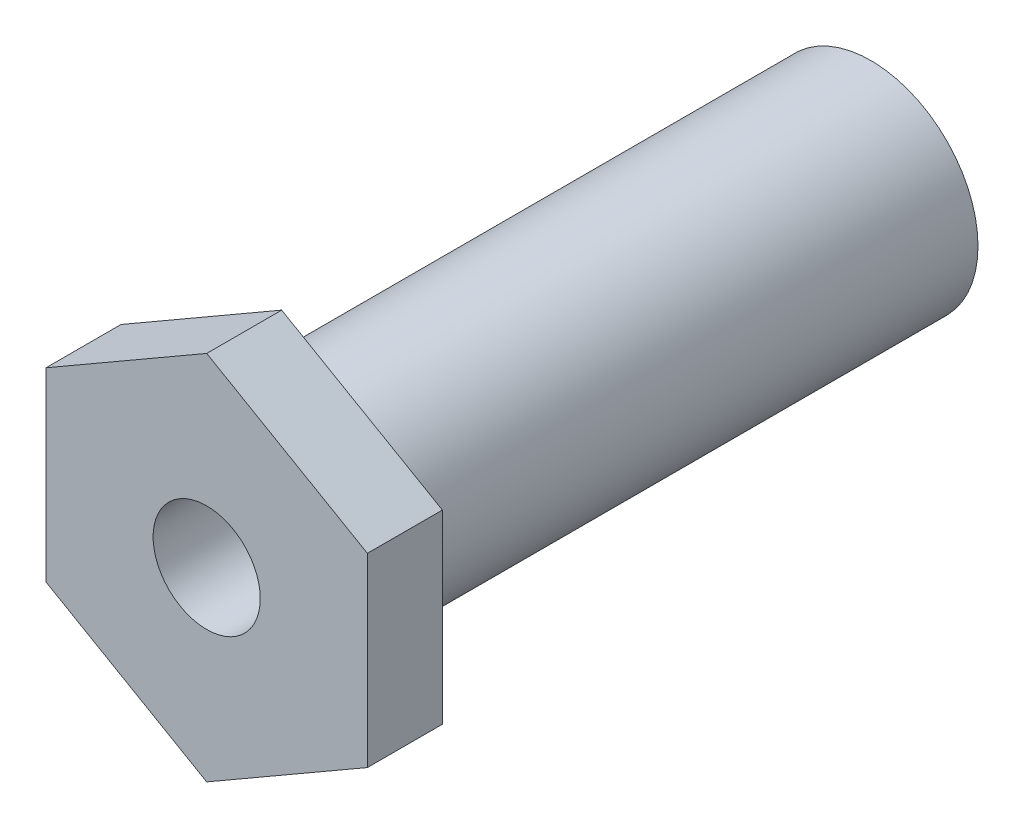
ISO-10303-21;
HEADER;
FILE_DESCRIPTION(('STEP AP214'),'2;1');
FILE_NAME('part.step','',(''),(''),'','','');
FILE_SCHEMA(('AUTOMOTIVE_DESIGN { 1 0 10303 214 1 1 1 1 }'));
ENDSEC;
DATA;
#1=APPLICATION_CONTEXT('core data for automotive mechanical design processes');
#2=APPLICATION_PROTOCOL_DEFINITION('international standard','automotive_design',2000,#1);
#3=PRODUCT_CONTEXT('',#1,'mechanical');
#4=PRODUCT('Part','Part','',(#3));
#5=PRODUCT_RELATED_PRODUCT_CATEGORY('part','',(#4));
#6=PRODUCT_DEFINITION_FORMATION('','',#4);
#7=PRODUCT_DEFINITION_CONTEXT('part definition',#1,'design');
#8=PRODUCT_DEFINITION('design','',#6,#7);
#9=PRODUCT_DEFINITION_SHAPE('','',#8);
#10=(LENGTH_UNIT() NAMED_UNIT(*) SI_UNIT(.MILLI.,.METRE.));
#11=(NAMED_UNIT(*) PLANE_ANGLE_UNIT() SI_UNIT($,.RADIAN.));
#12=(NAMED_UNIT(*) SI_UNIT($,.STERADIAN.) SOLID_ANGLE_UNIT());
#13=UNCERTAINTY_MEASURE_WITH_UNIT(LENGTH_MEASURE(1.E-05),#10,'distance_accuracy_value','');
#14=(GEOMETRIC_REPRESENTATION_CONTEXT(3) GLOBAL_UNCERTAINTY_ASSIGNED_CONTEXT((#13)) GLOBAL_UNIT_ASSIGNED_CONTEXT((#10,
#11,#12)) REPRESENTATION_CONTEXT('',''));
#15=CARTESIAN_POINT('',(0.,0.,0.));
#16=DIRECTION('',(0.,0.,1.));
#17=DIRECTION('',(1.,0.,0.));
#18=AXIS2_PLACEMENT_3D('',#15,#16,#17);
#19=CARTESIAN_POINT('',(0.,0.,50.));
#20=DIRECTION('',(0.,0.,1.));
#21=DIRECTION('',(1.,0.,0.));
#22=AXIS2_PLACEMENT_3D('',#19,#20,#21);
#23=PLANE('',#22);
#24=CARTESIAN_POINT('',(0.,0.,50.));
#25=DIRECTION('',(0.,0.,1.));
#26=DIRECTION('',(1.,0.,0.));
#27=AXIS2_PLACEMENT_3D('',#24,#25,#26);
#28=CIRCLE('',#27,5.);
#29=CARTESIAN_POINT('',(5.,0.,50.));
#30=VERTEX_POINT('',#29);
#31=EDGE_CURVE('E112',#30,#30,#28,.T.);
#32=ORIENTED_EDGE('',*,*,#31,.T.);
#33=EDGE_LOOP('',(#32));
#34=FACE_BOUND('',#33,.T.);
#35=ADVANCED_FACE('F14',(#34),#23,.T.);
#36=CARTESIAN_POINT('',(0.,0.,60.));
#37=DIRECTION('',(0.,0.,1.));
#38=DIRECTION('',(1.,0.,0.));
#39=AXIS2_PLACEMENT_3D('',#36,#37,#38);
#40=CYLINDRICAL_SURFACE('',#39,5.);
#41=CARTESIAN_POINT('',(0.,0.,62.));
#42=DIRECTION('',(0.,0.,1.));
#43=DIRECTION('',(1.,0.,0.));
#44=AXIS2_PLACEMENT_3D('',#41,#42,#43);
#45=CIRCLE('',#44,5.);
#46=CARTESIAN_POINT('',(5.,0.,62.));
#47=VERTEX_POINT('',#46);
#48=EDGE_CURVE('E109',#47,#47,#45,.T.);
#49=ORIENTED_EDGE('',*,*,#48,.T.);
#50=EDGE_LOOP('',(#49));
#51=FACE_BOUND('',#50,.T.);
#52=ORIENTED_EDGE('',*,*,#31,.F.);
#53=EDGE_LOOP('',(#52));
#54=FACE_BOUND('',#53,.T.);
#55=ADVANCED_FACE('F151',(#51,#54),#40,.F.);
#56=CARTESIAN_POINT('',(-5.,0.,62.));
#57=DIRECTION('',(0.,0.,1.));
#58=DIRECTION('',(1.,0.,0.));
#59=AXIS2_PLACEMENT_3D('',#56,#57,#58);
#60=PLANE('',#59);
#61=DIRECTION('',(-0.866025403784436,-0.5,0.));
#62=VECTOR('',#61,1.);
#63=CARTESIAN_POINT('',(15.,-8.66025403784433,62.));
#64=LINE('',#63,#62);
#65=CARTESIAN_POINT('',(15.,-8.66025403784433,62.));
#66=VERTEX_POINT('',#65);
#67=CARTESIAN_POINT('',(0.,-17.3205080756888,62.));
#68=VERTEX_POINT('',#67);
#69=EDGE_CURVE('E80',#66,#68,#64,.T.);
#70=ORIENTED_EDGE('',*,*,#69,.F.);
#71=DIRECTION('',(0.,1.,0.));
#72=VECTOR('',#71,1.);
#73=CARTESIAN_POINT('',(15.,-8.66025403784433,62.));
#74=LINE('',#73,#72);
#75=CARTESIAN_POINT('',(15.,8.66025403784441,62.));
#76=VERTEX_POINT('',#75);
#77=EDGE_CURVE('E97',#66,#76,#74,.T.);
#78=ORIENTED_EDGE('',*,*,#77,.T.);
#79=DIRECTION('',(-0.86602540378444,0.5,0.));
#80=VECTOR('',#79,1.);
#81=CARTESIAN_POINT('',(15.,8.66025403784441,62.));
#82=LINE('',#81,#80);
#83=CARTESIAN_POINT('',(0.,17.3205080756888,62.));
#84=VERTEX_POINT('',#83);
#85=EDGE_CURVE('E28',#76,#84,#82,.T.);
#86=ORIENTED_EDGE('',*,*,#85,.T.);
#87=DIRECTION('',(0.86602540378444,0.5,0.));
#88=VECTOR('',#87,1.);
#89=CARTESIAN_POINT('',(-15.,8.66025403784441,62.));
#90=LINE('',#89,#88);
#91=CARTESIAN_POINT('',(-15.,8.66025403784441,62.));
#92=VERTEX_POINT('',#91);
#93=EDGE_CURVE('E91',#92,#84,#90,.T.);
#94=ORIENTED_EDGE('',*,*,#93,.F.);
#95=DIRECTION('',(0.,1.,0.));
#96=VECTOR('',#95,1.);
#97=CARTESIAN_POINT('',(-15.,-8.66025403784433,62.));
#98=LINE('',#97,#96);
#99=CARTESIAN_POINT('',(-15.,-8.66025403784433,62.));
#100=VERTEX_POINT('',#99);
#101=EDGE_CURVE('E89',#100,#92,#98,.T.);
#102=ORIENTED_EDGE('',*,*,#101,.F.);
#103=DIRECTION('',(0.866025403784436,-0.5,0.));
#104=VECTOR('',#103,1.);
#105=CARTESIAN_POINT('',(-15.,-8.66025403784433,62.));
#106=LINE('',#105,#104);
#107=EDGE_CURVE('E71',#100,#68,#106,.T.);
#108=ORIENTED_EDGE('',*,*,#107,.T.);
#109=EDGE_LOOP('',(#70,#78,#86,#94,#102,#108));
#110=FACE_BOUND('',#109,.T.);
#111=ORIENTED_EDGE('',*,*,#48,.F.);
#112=EDGE_LOOP('',(#111));
#113=FACE_BOUND('',#112,.T.);
#114=ADVANCED_FACE('F85',(#110,#113),#60,.T.);
#115=CARTESIAN_POINT('',(15.,-8.66025403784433,52.));
#116=DIRECTION('',(-0.5,0.866025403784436,0.));
#117=DIRECTION('',(-0.866025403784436,-0.5,0.));
#118=AXIS2_PLACEMENT_3D('',#115,#116,#117);
#119=PLANE('',#118);
#120=DIRECTION('',(0.866025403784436,0.5,0.));
#121=VECTOR('',#120,1.);
#122=CARTESIAN_POINT('',(-7.49999999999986,-21.650635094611,55.));
#123=LINE('',#122,#121);
#124=CARTESIAN_POINT('',(0.,-17.3205080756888,55.));
#125=VERTEX_POINT('',#124);
#126=CARTESIAN_POINT('',(15.,-8.66025403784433,55.));
#127=VERTEX_POINT('',#126);
#128=EDGE_CURVE('E9',#125,#127,#123,.T.);
#129=ORIENTED_EDGE('',*,*,#128,.T.);
#130=DIRECTION('',(0.,0.,1.));
#131=VECTOR('',#130,1.);
#132=CARTESIAN_POINT('',(15.,-8.66025403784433,52.));
#133=LINE('',#132,#131);
#134=EDGE_CURVE('E36',#127,#66,#133,.T.);
#135=ORIENTED_EDGE('',*,*,#134,.T.);
#136=ORIENTED_EDGE('',*,*,#69,.T.);
#137=DIRECTION('',(0.,0.,1.));
#138=VECTOR('',#137,1.);
#139=CARTESIAN_POINT('',(0.,-17.3205080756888,52.));
#140=LINE('',#139,#138);
#141=EDGE_CURVE('E66',#125,#68,#140,.T.);
#142=ORIENTED_EDGE('',*,*,#141,.F.);
#143=EDGE_LOOP('',(#129,#135,#136,#142));
#144=FACE_BOUND('',#143,.T.);
#145=ADVANCED_FACE('F81',(#144),#119,.F.);
#146=CARTESIAN_POINT('',(-15.,-8.66025403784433,52.));
#147=DIRECTION('',(-0.5,-0.866025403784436,0.));
#148=DIRECTION('',(0.866025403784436,-0.5,0.));
#149=AXIS2_PLACEMENT_3D('',#146,#147,#148);
#150=PLANE('',#149);
#151=ORIENTED_EDGE('',*,*,#141,.T.);
#152=ORIENTED_EDGE('',*,*,#107,.F.);
#153=DIRECTION('',(0.,0.,1.));
#154=VECTOR('',#153,1.);
#155=CARTESIAN_POINT('',(-15.,-8.66025403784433,52.));
#156=LINE('',#155,#154);
#157=CARTESIAN_POINT('',(-15.,-8.66025403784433,55.));
#158=VERTEX_POINT('',#157);
#159=EDGE_CURVE('E77',#158,#100,#156,.T.);
#160=ORIENTED_EDGE('',*,*,#159,.F.);
#161=DIRECTION('',(-0.866025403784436,0.5,0.));
#162=VECTOR('',#161,1.);
#163=CARTESIAN_POINT('',(-22.5,-4.33012701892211,55.));
#164=LINE('',#163,#162);
#165=EDGE_CURVE('E21',#125,#158,#164,.T.);
#166=ORIENTED_EDGE('',*,*,#165,.F.);
#167=EDGE_LOOP('',(#151,#152,#160,#166));
#168=FACE_BOUND('',#167,.T.);
#169=ADVANCED_FACE('F68',(#168),#150,.T.);
#170=CARTESIAN_POINT('',(-15.,-8.66025403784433,52.));
#171=DIRECTION('',(1.,0.,0.));
#172=DIRECTION('',(0.,0.,-1.));
#173=AXIS2_PLACEMENT_3D('',#170,#171,#172);
#174=PLANE('',#173);
#175=DIRECTION('',(0.,-1.,0.));
#176=VECTOR('',#175,1.);
#177=CARTESIAN_POINT('',(-15.,0.,55.));
#178=LINE('',#177,#176);
#179=CARTESIAN_POINT('',(-15.,8.66025403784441,55.));
#180=VERTEX_POINT('',#179);
#181=EDGE_CURVE('E123',#180,#158,#178,.T.);
#182=ORIENTED_EDGE('',*,*,#181,.T.);
#183=ORIENTED_EDGE('',*,*,#159,.T.);
#184=ORIENTED_EDGE('',*,*,#101,.T.);
#185=DIRECTION('',(0.,0.,1.));
#186=VECTOR('',#185,1.);
#187=CARTESIAN_POINT('',(-15.,8.66025403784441,52.));
#188=LINE('',#187,#186);
#189=EDGE_CURVE('E101',#180,#92,#188,.T.);
#190=ORIENTED_EDGE('',*,*,#189,.F.);
#191=EDGE_LOOP('',(#182,#183,#184,#190));
#192=FACE_BOUND('',#191,.T.);
#193=ADVANCED_FACE('F139',(#192),#174,.F.);
#194=CARTESIAN_POINT('',(-15.,8.66025403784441,52.));
#195=DIRECTION('',(0.5,-0.86602540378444,0.));
#196=DIRECTION('',(0.86602540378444,0.5,0.));
#197=AXIS2_PLACEMENT_3D('',#194,#195,#196);
#198=PLANE('',#197);
#199=DIRECTION('',(-0.86602540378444,-0.5,0.));
#200=VECTOR('',#199,1.);
#201=CARTESIAN_POINT('',(-22.5,4.33012701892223,55.));
#202=LINE('',#201,#200);
#203=CARTESIAN_POINT('',(0.,17.3205080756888,55.));
#204=VERTEX_POINT('',#203);
#205=EDGE_CURVE('E121',#204,#180,#202,.T.);
#206=ORIENTED_EDGE('',*,*,#205,.T.);
#207=ORIENTED_EDGE('',*,*,#189,.T.);
#208=ORIENTED_EDGE('',*,*,#93,.T.);
#209=DIRECTION('',(0.,0.,1.));
#210=VECTOR('',#209,1.);
#211=CARTESIAN_POINT('',(0.,17.3205080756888,52.));
#212=LINE('',#211,#210);
#213=EDGE_CURVE('E99',#204,#84,#212,.T.);
#214=ORIENTED_EDGE('',*,*,#213,.F.);
#215=EDGE_LOOP('',(#206,#207,#208,#214));
#216=FACE_BOUND('',#215,.T.);
#217=ADVANCED_FACE('F134',(#216),#198,.F.);
#218=CARTESIAN_POINT('',(15.,8.66025403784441,52.));
#219=DIRECTION('',(0.5,0.86602540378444,0.));
#220=DIRECTION('',(-0.86602540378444,0.5,0.));
#221=AXIS2_PLACEMENT_3D('',#218,#219,#220);
#222=PLANE('',#221);
#223=ORIENTED_EDGE('',*,*,#213,.T.);
#224=ORIENTED_EDGE('',*,*,#85,.F.);
#225=DIRECTION('',(0.,0.,1.));
#226=VECTOR('',#225,1.);
#227=CARTESIAN_POINT('',(15.,8.66025403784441,52.));
#228=LINE('',#227,#226);
#229=CARTESIAN_POINT('',(15.,8.66025403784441,55.));
#230=VERTEX_POINT('',#229);
#231=EDGE_CURVE('E96',#230,#76,#228,.T.);
#232=ORIENTED_EDGE('',*,*,#231,.F.);
#233=DIRECTION('',(0.86602540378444,-0.5,0.));
#234=VECTOR('',#233,1.);
#235=CARTESIAN_POINT('',(-7.5,21.650635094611,55.));
#236=LINE('',#235,#234);
#237=EDGE_CURVE('E118',#204,#230,#236,.T.);
#238=ORIENTED_EDGE('',*,*,#237,.F.);
#239=EDGE_LOOP('',(#223,#224,#232,#238));
#240=FACE_BOUND('',#239,.T.);
#241=ADVANCED_FACE('F130',(#240),#222,.T.);
#242=CARTESIAN_POINT('',(15.,-8.66025403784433,52.));
#243=DIRECTION('',(1.,0.,0.));
#244=DIRECTION('',(0.,0.,-1.));
#245=AXIS2_PLACEMENT_3D('',#242,#243,#244);
#246=PLANE('',#245);
#247=ORIENTED_EDGE('',*,*,#231,.T.);
#248=ORIENTED_EDGE('',*,*,#77,.F.);
#249=ORIENTED_EDGE('',*,*,#134,.F.);
#250=DIRECTION('',(0.,-1.,0.));
#251=VECTOR('',#250,1.);
#252=CARTESIAN_POINT('',(15.,0.,55.));
#253=LINE('',#252,#251);
#254=EDGE_CURVE('E115',#230,#127,#253,.T.);
#255=ORIENTED_EDGE('',*,*,#254,.F.);
#256=EDGE_LOOP('',(#247,#248,#249,#255));
#257=FACE_BOUND('',#256,.T.);
#258=ADVANCED_FACE('F129',(#257),#246,.T.);
#259=CARTESIAN_POINT('',(-10.,0.,0.));
#260=DIRECTION('',(0.,0.,-1.));
#261=DIRECTION('',(-1.,0.,0.));
#262=AXIS2_PLACEMENT_3D('',#259,#260,#261);
#263=PLANE('',#262);
#264=CARTESIAN_POINT('',(0.,0.,0.));
#265=DIRECTION('',(0.,0.,1.));
#266=DIRECTION('',(1.,0.,0.));
#267=AXIS2_PLACEMENT_3D('',#264,#265,#266);
#268=CIRCLE('',#267,10.);
#269=CARTESIAN_POINT('',(10.,0.,0.));
#270=VERTEX_POINT('',#269);
#271=EDGE_CURVE('E76',#270,#270,#268,.T.);
#272=ORIENTED_EDGE('',*,*,#271,.F.);
#273=EDGE_LOOP('',(#272));
#274=FACE_BOUND('',#273,.T.);
#275=ADVANCED_FACE('F171',(#274),#263,.T.);
#276=CARTESIAN_POINT('',(0.,0.,60.));
#277=DIRECTION('',(0.,0.,1.));
#278=DIRECTION('',(1.,0.,0.));
#279=AXIS2_PLACEMENT_3D('',#276,#277,#278);
#280=CYLINDRICAL_SURFACE('',#279,10.);
#281=ORIENTED_EDGE('',*,*,#271,.T.);
#282=EDGE_LOOP('',(#281));
#283=FACE_BOUND('',#282,.T.);
#284=CARTESIAN_POINT('',(0.,0.,55.));
#285=DIRECTION('',(0.,0.,1.));
#286=DIRECTION('',(1.,0.,0.));
#287=AXIS2_PLACEMENT_3D('',#284,#285,#286);
#288=CIRCLE('',#287,10.);
#289=CARTESIAN_POINT('',(10.,0.,55.));
#290=VERTEX_POINT('',#289);
#291=EDGE_CURVE('E106',#290,#290,#288,.T.);
#292=ORIENTED_EDGE('',*,*,#291,.F.);
#293=EDGE_LOOP('',(#292));
#294=FACE_BOUND('',#293,.T.);
#295=ADVANCED_FACE('F168',(#283,#294),#280,.T.);
#296=CARTESIAN_POINT('',(-20.,0.,55.));
#297=DIRECTION('',(0.,0.,-1.));
#298=DIRECTION('',(-1.,0.,0.));
#299=AXIS2_PLACEMENT_3D('',#296,#297,#298);
#300=PLANE('',#299);
#301=ORIENTED_EDGE('',*,*,#128,.F.);
#302=ORIENTED_EDGE('',*,*,#165,.T.);
#303=ORIENTED_EDGE('',*,*,#181,.F.);
#304=ORIENTED_EDGE('',*,*,#205,.F.);
#305=ORIENTED_EDGE('',*,*,#237,.T.);
#306=ORIENTED_EDGE('',*,*,#254,.T.);
#307=EDGE_LOOP('',(#301,#302,#303,#304,#305,#306));
#308=FACE_BOUND('',#307,.T.);
#309=ORIENTED_EDGE('',*,*,#291,.T.);
#310=EDGE_LOOP('',(#309));
#311=FACE_BOUND('',#310,.T.);
#312=ADVANCED_FACE('F126',(#308,#311),#300,.T.);
#313=CLOSED_SHELL('',(#35,#55,#114,#145,#169,#193,#217,#241,#258,#275,#295,#312));
#314=MANIFOLD_SOLID_BREP('B1',#313);
#315=ADVANCED_BREP_SHAPE_REPRESENTATION('',(#18,#314),#14);
#316=SHAPE_DEFINITION_REPRESENTATION(#9,#315);
ENDSEC;
END-ISO-10303-21;
